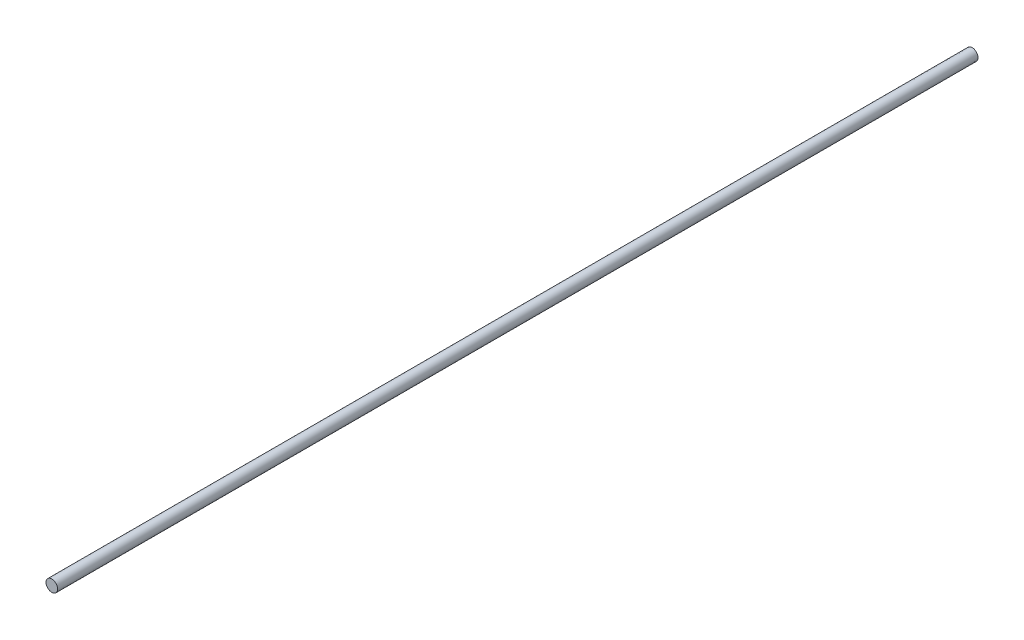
from build123d import *

# Parameters (mm, degrees)
ESQUISSE1_R      = 6
EXTRUSION1_DEPTH = 475


with BuildPart() as part:
    # Esquisse1 → Extrusion1 (new, symmetric)
    with BuildSketch(Plane.XY):
        with Locations(Location((0, 0, 0), (0, 0, 180))):
            Circle(ESQUISSE1_R)
    extrude(amount=EXTRUSION1_DEPTH, both=True)


solid = part.part
